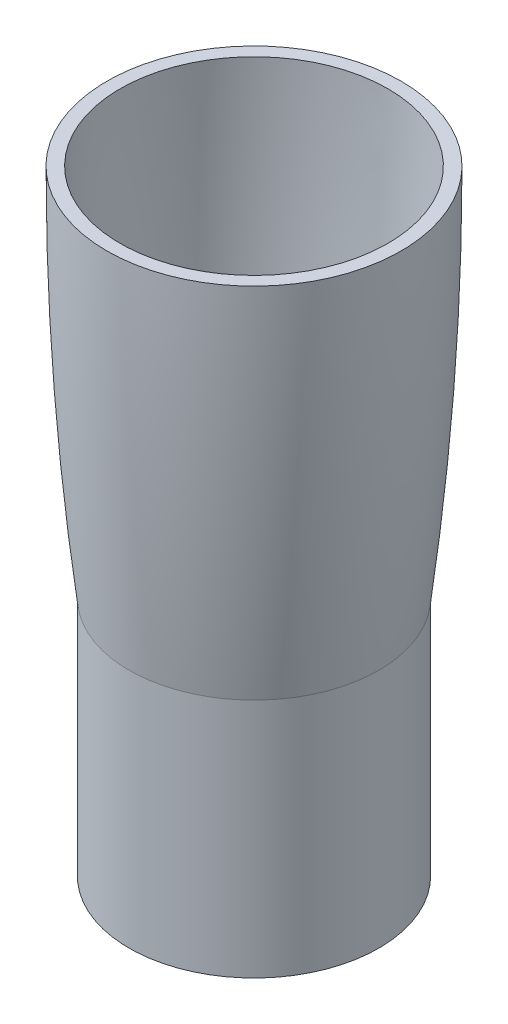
ISO-10303-21;
HEADER;
FILE_DESCRIPTION(('STEP AP214'),'2;1');
FILE_NAME('part.step','',(''),(''),'','','');
FILE_SCHEMA(('AUTOMOTIVE_DESIGN { 1 0 10303 214 1 1 1 1 }'));
ENDSEC;
DATA;
#1=APPLICATION_CONTEXT('core data for automotive mechanical design processes');
#2=APPLICATION_PROTOCOL_DEFINITION('international standard','automotive_design',2000,#1);
#3=PRODUCT_CONTEXT('',#1,'mechanical');
#4=PRODUCT('Part','Part','',(#3));
#5=PRODUCT_RELATED_PRODUCT_CATEGORY('part','',(#4));
#6=PRODUCT_DEFINITION_FORMATION('','',#4);
#7=PRODUCT_DEFINITION_CONTEXT('part definition',#1,'design');
#8=PRODUCT_DEFINITION('design','',#6,#7);
#9=PRODUCT_DEFINITION_SHAPE('','',#8);
#10=(LENGTH_UNIT() NAMED_UNIT(*) SI_UNIT(.MILLI.,.METRE.));
#11=(NAMED_UNIT(*) PLANE_ANGLE_UNIT() SI_UNIT($,.RADIAN.));
#12=(NAMED_UNIT(*) SI_UNIT($,.STERADIAN.) SOLID_ANGLE_UNIT());
#13=UNCERTAINTY_MEASURE_WITH_UNIT(LENGTH_MEASURE(1.E-05),#10,'distance_accuracy_value','');
#14=(GEOMETRIC_REPRESENTATION_CONTEXT(3) GLOBAL_UNCERTAINTY_ASSIGNED_CONTEXT((#13)) GLOBAL_UNIT_ASSIGNED_CONTEXT((#10,
#11,#12)) REPRESENTATION_CONTEXT('',''));
#15=CARTESIAN_POINT('',(0.,0.,0.));
#16=DIRECTION('',(0.,0.,1.));
#17=DIRECTION('',(1.,0.,0.));
#18=AXIS2_PLACEMENT_3D('',#15,#16,#17);
#19=CARTESIAN_POINT('',(0.,152.756368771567,0.));
#20=DIRECTION('',(0.,-1.,0.));
#21=DIRECTION('',(0.,0.,-1.));
#22=AXIS2_PLACEMENT_3D('',#19,#20,#21);
#23=DEGENERATE_TOROIDAL_SURFACE('',#22,750.225107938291,783.500758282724,.F.);
#24=CARTESIAN_POINT('',(0.,59.9791038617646,0.));
#25=DIRECTION('',(0.,-1.,0.));
#26=DIRECTION('',(0.,0.,-1.));
#27=AXIS2_PLACEMENT_3D('',#24,#25,#26);
#28=CIRCLE('',#27,27.7632064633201);
#29=CARTESIAN_POINT('',(0.,59.9791038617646,-27.7632064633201));
#30=VERTEX_POINT('',#29);
#31=EDGE_CURVE('E10',#30,#30,#28,.T.);
#32=ORIENTED_EDGE('',*,*,#31,.T.);
#33=EDGE_LOOP('',(#32));
#34=FACE_BOUND('',#33,.T.);
#35=CARTESIAN_POINT('',(0.,152.756378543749,0.));
#36=DIRECTION('',(0.,-1.,0.));
#37=DIRECTION('',(0.,0.,-1.));
#38=AXIS2_PLACEMENT_3D('',#35,#36,#37);
#39=CIRCLE('',#38,33.2756503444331);
#40=CARTESIAN_POINT('',(0.,152.756378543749,-33.2756503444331));
#41=VERTEX_POINT('',#40);
#42=EDGE_CURVE('E50',#41,#41,#39,.T.);
#43=ORIENTED_EDGE('',*,*,#42,.F.);
#44=EDGE_LOOP('',(#43));
#45=FACE_BOUND('',#44,.T.);
#46=ADVANCED_FACE('F28',(#34,#45),#23,.T.);
#47=CARTESIAN_POINT('',(0.,0.,0.));
#48=DIRECTION('',(0.,-1.,0.));
#49=DIRECTION('',(0.,0.,-1.));
#50=AXIS2_PLACEMENT_3D('',#47,#48,#49);
#51=CYLINDRICAL_SURFACE('',#50,27.7632064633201);
#52=CARTESIAN_POINT('',(0.,0.,0.));
#53=DIRECTION('',(0.,-1.,0.));
#54=DIRECTION('',(0.,0.,-1.));
#55=AXIS2_PLACEMENT_3D('',#52,#53,#54);
#56=CIRCLE('',#55,27.7632064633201);
#57=CARTESIAN_POINT('',(0.,0.,-27.7632064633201));
#58=VERTEX_POINT('',#57);
#59=EDGE_CURVE('E34',#58,#58,#56,.T.);
#60=ORIENTED_EDGE('',*,*,#59,.T.);
#61=EDGE_LOOP('',(#60));
#62=FACE_BOUND('',#61,.T.);
#63=ORIENTED_EDGE('',*,*,#31,.F.);
#64=EDGE_LOOP('',(#63));
#65=FACE_BOUND('',#64,.T.);
#66=ADVANCED_FACE('F58',(#62,#65),#51,.F.);
#67=CARTESIAN_POINT('',(27.7632064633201,0.,0.));
#68=DIRECTION('',(0.,-1.,0.));
#69=DIRECTION('',(0.,0.,-1.));
#70=AXIS2_PLACEMENT_3D('',#67,#68,#69);
#71=PLANE('',#70);
#72=CARTESIAN_POINT('',(0.,0.,0.));
#73=DIRECTION('',(0.,-1.,0.));
#74=DIRECTION('',(0.,0.,-1.));
#75=AXIS2_PLACEMENT_3D('',#72,#73,#74);
#76=CIRCLE('',#75,31.02920646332);
#77=CARTESIAN_POINT('',(0.,0.,-31.02920646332));
#78=VERTEX_POINT('',#77);
#79=EDGE_CURVE('E38',#78,#78,#76,.T.);
#80=ORIENTED_EDGE('',*,*,#79,.T.);
#81=EDGE_LOOP('',(#80));
#82=FACE_BOUND('',#81,.T.);
#83=ORIENTED_EDGE('',*,*,#59,.F.);
#84=EDGE_LOOP('',(#83));
#85=FACE_BOUND('',#84,.T.);
#86=ADVANCED_FACE('F62',(#82,#85),#71,.T.);
#87=CARTESIAN_POINT('',(0.,0.,0.));
#88=DIRECTION('',(0.,-1.,0.));
#89=DIRECTION('',(0.,0.,-1.));
#90=AXIS2_PLACEMENT_3D('',#87,#88,#89);
#91=CYLINDRICAL_SURFACE('',#90,31.02920646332);
#92=CARTESIAN_POINT('',(0.,59.7852622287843,0.));
#93=DIRECTION('',(0.,-1.,0.));
#94=DIRECTION('',(0.,0.,-1.));
#95=AXIS2_PLACEMENT_3D('',#92,#93,#94);
#96=CIRCLE('',#95,31.02920646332);
#97=CARTESIAN_POINT('',(0.,59.7852622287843,-31.02920646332));
#98=VERTEX_POINT('',#97);
#99=EDGE_CURVE('E42',#98,#98,#96,.T.);
#100=ORIENTED_EDGE('',*,*,#99,.T.);
#101=EDGE_LOOP('',(#100));
#102=FACE_BOUND('',#101,.T.);
#103=ORIENTED_EDGE('',*,*,#79,.F.);
#104=EDGE_LOOP('',(#103));
#105=FACE_BOUND('',#104,.T.);
#106=ADVANCED_FACE('F66',(#102,#105),#91,.T.);
#107=CARTESIAN_POINT('',(0.,152.756368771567,0.));
#108=DIRECTION('',(0.,-1.,0.));
#109=DIRECTION('',(0.,0.,-1.));
#110=AXIS2_PLACEMENT_3D('',#107,#108,#109);
#111=DEGENERATE_TOROIDAL_SURFACE('',#110,750.225107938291,786.766757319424,.F.);
#112=CARTESIAN_POINT('',(0.,152.756378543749,0.));
#113=DIRECTION('',(0.,-1.,0.));
#114=DIRECTION('',(0.,0.,-1.));
#115=AXIS2_PLACEMENT_3D('',#112,#113,#114);
#116=CIRCLE('',#115,36.5416493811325);
#117=CARTESIAN_POINT('',(0.,152.756378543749,-36.5416493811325));
#118=VERTEX_POINT('',#117);
#119=EDGE_CURVE('E47',#118,#118,#116,.T.);
#120=ORIENTED_EDGE('',*,*,#119,.T.);
#121=EDGE_LOOP('',(#120));
#122=FACE_BOUND('',#121,.T.);
#123=ORIENTED_EDGE('',*,*,#99,.F.);
#124=EDGE_LOOP('',(#123));
#125=FACE_BOUND('',#124,.T.);
#126=ADVANCED_FACE('F73',(#122,#125),#111,.F.);
#127=CARTESIAN_POINT('',(33.2756503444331,152.756378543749,0.));
#128=DIRECTION('',(0.,1.,0.));
#129=DIRECTION('',(0.,0.,1.));
#130=AXIS2_PLACEMENT_3D('',#127,#128,#129);
#131=PLANE('',#130);
#132=ORIENTED_EDGE('',*,*,#42,.T.);
#133=EDGE_LOOP('',(#132));
#134=FACE_BOUND('',#133,.T.);
#135=ORIENTED_EDGE('',*,*,#119,.F.);
#136=EDGE_LOOP('',(#135));
#137=FACE_BOUND('',#136,.T.);
#138=ADVANCED_FACE('F54',(#134,#137),#131,.T.);
#139=CLOSED_SHELL('',(#46,#66,#86,#106,#126,#138));
#140=MANIFOLD_SOLID_BREP('B2',#139);
#141=ADVANCED_BREP_SHAPE_REPRESENTATION('',(#18,#140),#14);
#142=SHAPE_DEFINITION_REPRESENTATION(#9,#141);
ENDSEC;
END-ISO-10303-21;
